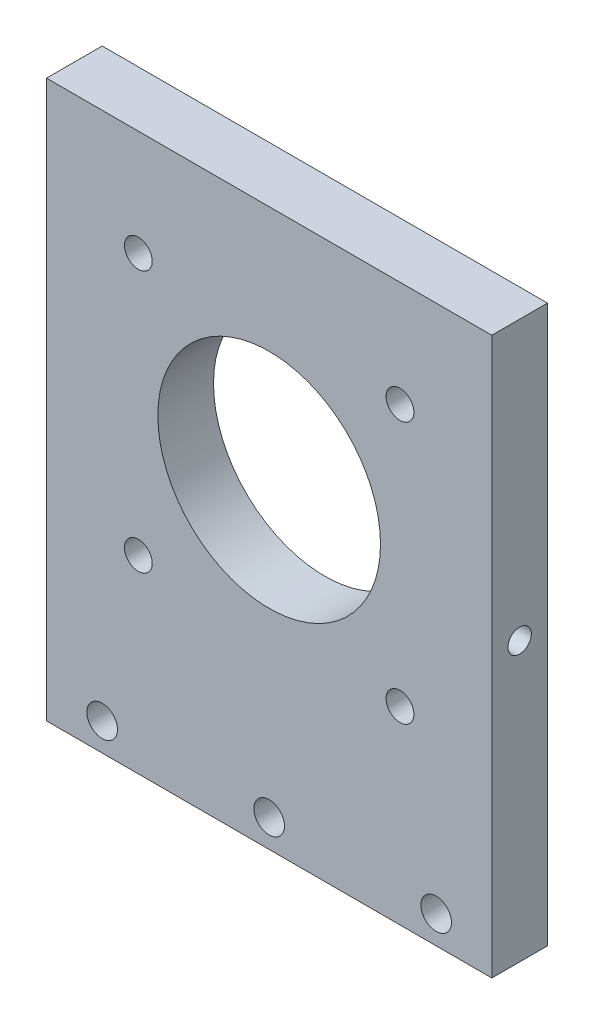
ISO-10303-21;
HEADER;
FILE_DESCRIPTION(('STEP AP214'),'2;1');
FILE_NAME('part.step','',(''),(''),'','','');
FILE_SCHEMA(('AUTOMOTIVE_DESIGN { 1 0 10303 214 1 1 1 1 }'));
ENDSEC;
DATA;
#1=APPLICATION_CONTEXT('core data for automotive mechanical design processes');
#2=APPLICATION_PROTOCOL_DEFINITION('international standard','automotive_design',2000,#1);
#3=PRODUCT_CONTEXT('',#1,'mechanical');
#4=PRODUCT('Part','Part','',(#3));
#5=PRODUCT_RELATED_PRODUCT_CATEGORY('part','',(#4));
#6=PRODUCT_DEFINITION_FORMATION('','',#4);
#7=PRODUCT_DEFINITION_CONTEXT('part definition',#1,'design');
#8=PRODUCT_DEFINITION('design','',#6,#7);
#9=PRODUCT_DEFINITION_SHAPE('','',#8);
#10=(LENGTH_UNIT() NAMED_UNIT(*) SI_UNIT(.MILLI.,.METRE.));
#11=(NAMED_UNIT(*) PLANE_ANGLE_UNIT() SI_UNIT($,.RADIAN.));
#12=(NAMED_UNIT(*) SI_UNIT($,.STERADIAN.) SOLID_ANGLE_UNIT());
#13=UNCERTAINTY_MEASURE_WITH_UNIT(LENGTH_MEASURE(1.E-05),#10,'distance_accuracy_value','');
#14=(GEOMETRIC_REPRESENTATION_CONTEXT(3) GLOBAL_UNCERTAINTY_ASSIGNED_CONTEXT((#13)) GLOBAL_UNIT_ASSIGNED_CONTEXT((#10,
#11,#12)) REPRESENTATION_CONTEXT('',''));
#15=CARTESIAN_POINT('',(0.,0.,0.));
#16=DIRECTION('',(0.,0.,1.));
#17=DIRECTION('',(1.,0.,0.));
#18=AXIS2_PLACEMENT_3D('',#15,#16,#17);
#19=CARTESIAN_POINT('',(-40.,50.,10.));
#20=DIRECTION('',(1.,0.,0.));
#21=DIRECTION('',(0.,1.,0.));
#22=AXIS2_PLACEMENT_3D('',#19,#20,#21);
#23=PLANE('',#22);
#24=CARTESIAN_POINT('',(-40.,0.,5.));
#25=DIRECTION('',(-1.,0.,0.));
#26=DIRECTION('',(0.,0.,1.));
#27=AXIS2_PLACEMENT_3D('',#24,#25,#26);
#28=CIRCLE('',#27,2.09999999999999);
#29=CARTESIAN_POINT('',(-40.,0.,7.09999999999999));
#30=VERTEX_POINT('',#29);
#31=EDGE_CURVE('E102',#30,#30,#28,.T.);
#32=ORIENTED_EDGE('',*,*,#31,.F.);
#33=EDGE_LOOP('',(#32));
#34=FACE_BOUND('',#33,.T.);
#35=DIRECTION('',(0.,-1.,0.));
#36=VECTOR('',#35,1.);
#37=CARTESIAN_POINT('',(-40.,50.,0.));
#38=LINE('',#37,#36);
#39=CARTESIAN_POINT('',(-40.,50.,0.));
#40=VERTEX_POINT('',#39);
#41=CARTESIAN_POINT('',(-40.,-50.,0.));
#42=VERTEX_POINT('',#41);
#43=EDGE_CURVE('E160',#40,#42,#38,.T.);
#44=ORIENTED_EDGE('',*,*,#43,.T.);
#45=DIRECTION('',(0.,0.,-1.));
#46=VECTOR('',#45,1.);
#47=CARTESIAN_POINT('',(-40.,-50.,10.));
#48=LINE('',#47,#46);
#49=CARTESIAN_POINT('',(-40.,-50.,10.));
#50=VERTEX_POINT('',#49);
#51=EDGE_CURVE('E11',#50,#42,#48,.T.);
#52=ORIENTED_EDGE('',*,*,#51,.F.);
#53=DIRECTION('',(0.,-1.,0.));
#54=VECTOR('',#53,1.);
#55=CARTESIAN_POINT('',(-40.,50.,10.));
#56=LINE('',#55,#54);
#57=CARTESIAN_POINT('',(-40.,50.,10.));
#58=VERTEX_POINT('',#57);
#59=EDGE_CURVE('E161',#58,#50,#56,.T.);
#60=ORIENTED_EDGE('',*,*,#59,.F.);
#61=DIRECTION('',(0.,0.,-1.));
#62=VECTOR('',#61,1.);
#63=CARTESIAN_POINT('',(-40.,50.,10.));
#64=LINE('',#63,#62);
#65=EDGE_CURVE('E167',#58,#40,#64,.T.);
#66=ORIENTED_EDGE('',*,*,#65,.T.);
#67=EDGE_LOOP('',(#44,#52,#60,#66));
#68=FACE_BOUND('',#67,.T.);
#69=ADVANCED_FACE('F37',(#34,#68),#23,.F.);
#70=CARTESIAN_POINT('',(40.,-50.,10.));
#71=DIRECTION('',(0.,1.,0.));
#72=DIRECTION('',(-1.,0.,0.));
#73=AXIS2_PLACEMENT_3D('',#70,#71,#72);
#74=PLANE('',#73);
#75=DIRECTION('',(1.,0.,0.));
#76=VECTOR('',#75,1.);
#77=CARTESIAN_POINT('',(40.,-50.,0.));
#78=LINE('',#77,#76);
#79=CARTESIAN_POINT('',(40.,-50.,0.));
#80=VERTEX_POINT('',#79);
#81=EDGE_CURVE('E170',#42,#80,#78,.T.);
#82=ORIENTED_EDGE('',*,*,#81,.T.);
#83=DIRECTION('',(0.,0.,-1.));
#84=VECTOR('',#83,1.);
#85=CARTESIAN_POINT('',(40.,-50.,10.));
#86=LINE('',#85,#84);
#87=CARTESIAN_POINT('',(40.,-50.,10.));
#88=VERTEX_POINT('',#87);
#89=EDGE_CURVE('E45',#88,#80,#86,.T.);
#90=ORIENTED_EDGE('',*,*,#89,.F.);
#91=DIRECTION('',(1.,0.,0.));
#92=VECTOR('',#91,1.);
#93=CARTESIAN_POINT('',(40.,-50.,10.));
#94=LINE('',#93,#92);
#95=EDGE_CURVE('E84',#50,#88,#94,.T.);
#96=ORIENTED_EDGE('',*,*,#95,.F.);
#97=ORIENTED_EDGE('',*,*,#51,.T.);
#98=EDGE_LOOP('',(#82,#90,#96,#97));
#99=FACE_BOUND('',#98,.T.);
#100=ADVANCED_FACE('F194',(#99),#74,.F.);
#101=CARTESIAN_POINT('',(40.,50.,10.));
#102=DIRECTION('',(-1.,0.,0.));
#103=DIRECTION('',(0.,-1.,0.));
#104=AXIS2_PLACEMENT_3D('',#101,#102,#103);
#105=PLANE('',#104);
#106=CARTESIAN_POINT('',(40.,0.,5.));
#107=DIRECTION('',(1.,0.,0.));
#108=DIRECTION('',(0.,0.,-1.));
#109=AXIS2_PLACEMENT_3D('',#106,#107,#108);
#110=CIRCLE('',#109,2.09999999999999);
#111=CARTESIAN_POINT('',(40.,0.,2.90000000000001));
#112=VERTEX_POINT('',#111);
#113=EDGE_CURVE('E101',#112,#112,#110,.T.);
#114=ORIENTED_EDGE('',*,*,#113,.F.);
#115=EDGE_LOOP('',(#114));
#116=FACE_BOUND('',#115,.T.);
#117=DIRECTION('',(0.,1.,0.));
#118=VECTOR('',#117,1.);
#119=CARTESIAN_POINT('',(40.,50.,0.));
#120=LINE('',#119,#118);
#121=CARTESIAN_POINT('',(40.,50.,0.));
#122=VERTEX_POINT('',#121);
#123=EDGE_CURVE('E71',#80,#122,#120,.T.);
#124=ORIENTED_EDGE('',*,*,#123,.T.);
#125=DIRECTION('',(0.,0.,-1.));
#126=VECTOR('',#125,1.);
#127=CARTESIAN_POINT('',(40.,50.,10.));
#128=LINE('',#127,#126);
#129=CARTESIAN_POINT('',(40.,50.,10.));
#130=VERTEX_POINT('',#129);
#131=EDGE_CURVE('E175',#130,#122,#128,.T.);
#132=ORIENTED_EDGE('',*,*,#131,.F.);
#133=DIRECTION('',(0.,1.,0.));
#134=VECTOR('',#133,1.);
#135=CARTESIAN_POINT('',(40.,50.,10.));
#136=LINE('',#135,#134);
#137=EDGE_CURVE('E164',#88,#130,#136,.T.);
#138=ORIENTED_EDGE('',*,*,#137,.F.);
#139=ORIENTED_EDGE('',*,*,#89,.T.);
#140=EDGE_LOOP('',(#124,#132,#138,#139));
#141=FACE_BOUND('',#140,.T.);
#142=ADVANCED_FACE('F177',(#116,#141),#105,.F.);
#143=CARTESIAN_POINT('',(40.,50.,10.));
#144=DIRECTION('',(0.,-1.,0.));
#145=DIRECTION('',(0.,0.,-1.));
#146=AXIS2_PLACEMENT_3D('',#143,#144,#145);
#147=PLANE('',#146);
#148=DIRECTION('',(-1.,0.,0.));
#149=VECTOR('',#148,1.);
#150=CARTESIAN_POINT('',(40.,50.,0.));
#151=LINE('',#150,#149);
#152=EDGE_CURVE('E77',#122,#40,#151,.T.);
#153=ORIENTED_EDGE('',*,*,#152,.T.);
#154=ORIENTED_EDGE('',*,*,#65,.F.);
#155=DIRECTION('',(-1.,0.,0.));
#156=VECTOR('',#155,1.);
#157=CARTESIAN_POINT('',(40.,50.,10.));
#158=LINE('',#157,#156);
#159=EDGE_CURVE('E53',#130,#58,#158,.T.);
#160=ORIENTED_EDGE('',*,*,#159,.F.);
#161=ORIENTED_EDGE('',*,*,#131,.T.);
#162=EDGE_LOOP('',(#153,#154,#160,#161));
#163=FACE_BOUND('',#162,.T.);
#164=ADVANCED_FACE('F184',(#163),#147,.F.);
#165=CARTESIAN_POINT('',(0.,0.,10.));
#166=DIRECTION('',(0.,0.,-1.));
#167=DIRECTION('',(-1.,0.,0.));
#168=AXIS2_PLACEMENT_3D('',#165,#166,#167);
#169=PLANE('',#168);
#170=CARTESIAN_POINT('',(23.5,31.,10.));
#171=DIRECTION('',(0.,0.,-1.));
#172=DIRECTION('',(-1.,0.,0.));
#173=AXIS2_PLACEMENT_3D('',#170,#171,#172);
#174=CIRCLE('',#173,2.5);
#175=CARTESIAN_POINT('',(21.,31.,10.));
#176=VERTEX_POINT('',#175);
#177=EDGE_CURVE('E113',#176,#176,#174,.T.);
#178=ORIENTED_EDGE('',*,*,#177,.T.);
#179=EDGE_LOOP('',(#178));
#180=FACE_BOUND('',#179,.T.);
#181=CARTESIAN_POINT('',(-23.5,31.,10.));
#182=DIRECTION('',(0.,0.,-1.));
#183=DIRECTION('',(-1.,0.,0.));
#184=AXIS2_PLACEMENT_3D('',#181,#182,#183);
#185=CIRCLE('',#184,2.5);
#186=CARTESIAN_POINT('',(-26.,31.,10.));
#187=VERTEX_POINT('',#186);
#188=EDGE_CURVE('E120',#187,#187,#185,.T.);
#189=ORIENTED_EDGE('',*,*,#188,.T.);
#190=EDGE_LOOP('',(#189));
#191=FACE_BOUND('',#190,.T.);
#192=CARTESIAN_POINT('',(-23.5,-16.,10.));
#193=DIRECTION('',(0.,0.,-1.));
#194=DIRECTION('',(-1.,0.,0.));
#195=AXIS2_PLACEMENT_3D('',#192,#193,#194);
#196=CIRCLE('',#195,2.5);
#197=CARTESIAN_POINT('',(-26.,-16.,10.));
#198=VERTEX_POINT('',#197);
#199=EDGE_CURVE('E126',#198,#198,#196,.T.);
#200=ORIENTED_EDGE('',*,*,#199,.T.);
#201=EDGE_LOOP('',(#200));
#202=FACE_BOUND('',#201,.T.);
#203=CARTESIAN_POINT('',(23.5,-16.,10.));
#204=DIRECTION('',(0.,0.,-1.));
#205=DIRECTION('',(-1.,0.,0.));
#206=AXIS2_PLACEMENT_3D('',#203,#204,#205);
#207=CIRCLE('',#206,2.5);
#208=CARTESIAN_POINT('',(21.,-16.,10.));
#209=VERTEX_POINT('',#208);
#210=EDGE_CURVE('E132',#209,#209,#207,.T.);
#211=ORIENTED_EDGE('',*,*,#210,.T.);
#212=EDGE_LOOP('',(#211));
#213=FACE_BOUND('',#212,.T.);
#214=CARTESIAN_POINT('',(0.,7.5,10.));
#215=DIRECTION('',(0.,0.,-1.));
#216=DIRECTION('',(-1.,0.,0.));
#217=AXIS2_PLACEMENT_3D('',#214,#215,#216);
#218=CIRCLE('',#217,20.);
#219=CARTESIAN_POINT('',(-20.,7.5,10.));
#220=VERTEX_POINT('',#219);
#221=EDGE_CURVE('E137',#220,#220,#218,.T.);
#222=ORIENTED_EDGE('',*,*,#221,.T.);
#223=EDGE_LOOP('',(#222));
#224=FACE_BOUND('',#223,.T.);
#225=CARTESIAN_POINT('',(30.,-45.,9.99999999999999));
#226=DIRECTION('',(0.,0.,-1.));
#227=DIRECTION('',(-1.,0.,0.));
#228=AXIS2_PLACEMENT_3D('',#225,#226,#227);
#229=CIRCLE('',#228,2.74999999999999);
#230=CARTESIAN_POINT('',(27.25,-45.,9.99999999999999));
#231=VERTEX_POINT('',#230);
#232=EDGE_CURVE('E145',#231,#231,#229,.T.);
#233=ORIENTED_EDGE('',*,*,#232,.T.);
#234=EDGE_LOOP('',(#233));
#235=FACE_BOUND('',#234,.T.);
#236=CARTESIAN_POINT('',(0.,-45.,9.99999999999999));
#237=DIRECTION('',(0.,0.,-1.));
#238=DIRECTION('',(-1.,0.,0.));
#239=AXIS2_PLACEMENT_3D('',#236,#237,#238);
#240=CIRCLE('',#239,2.74999999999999);
#241=CARTESIAN_POINT('',(-2.74999999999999,-45.,9.99999999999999));
#242=VERTEX_POINT('',#241);
#243=EDGE_CURVE('E151',#242,#242,#240,.T.);
#244=ORIENTED_EDGE('',*,*,#243,.T.);
#245=EDGE_LOOP('',(#244));
#246=FACE_BOUND('',#245,.T.);
#247=CARTESIAN_POINT('',(-30.,-45.,9.99999999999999));
#248=DIRECTION('',(0.,0.,-1.));
#249=DIRECTION('',(-1.,0.,0.));
#250=AXIS2_PLACEMENT_3D('',#247,#248,#249);
#251=CIRCLE('',#250,2.74999999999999);
#252=CARTESIAN_POINT('',(-32.75,-45.,9.99999999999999));
#253=VERTEX_POINT('',#252);
#254=EDGE_CURVE('E157',#253,#253,#251,.T.);
#255=ORIENTED_EDGE('',*,*,#254,.T.);
#256=EDGE_LOOP('',(#255));
#257=FACE_BOUND('',#256,.T.);
#258=ORIENTED_EDGE('',*,*,#59,.T.);
#259=ORIENTED_EDGE('',*,*,#95,.T.);
#260=ORIENTED_EDGE('',*,*,#137,.T.);
#261=ORIENTED_EDGE('',*,*,#159,.T.);
#262=EDGE_LOOP('',(#258,#259,#260,#261));
#263=FACE_BOUND('',#262,.T.);
#264=ADVANCED_FACE('F186',(#180,#191,#202,#213,#224,#235,#246,#257,#263),#169,.F.);
#265=CARTESIAN_POINT('',(0.,0.,0.));
#266=DIRECTION('',(0.,0.,-1.));
#267=DIRECTION('',(-1.,0.,0.));
#268=AXIS2_PLACEMENT_3D('',#265,#266,#267);
#269=PLANE('',#268);
#270=CARTESIAN_POINT('',(23.5,31.,0.));
#271=DIRECTION('',(0.,0.,-1.));
#272=DIRECTION('',(-1.,0.,0.));
#273=AXIS2_PLACEMENT_3D('',#270,#271,#272);
#274=CIRCLE('',#273,2.5);
#275=CARTESIAN_POINT('',(21.,31.,0.));
#276=VERTEX_POINT('',#275);
#277=EDGE_CURVE('E117',#276,#276,#274,.T.);
#278=ORIENTED_EDGE('',*,*,#277,.F.);
#279=EDGE_LOOP('',(#278));
#280=FACE_BOUND('',#279,.T.);
#281=CARTESIAN_POINT('',(-23.5,31.,0.));
#282=DIRECTION('',(0.,0.,-1.));
#283=DIRECTION('',(-1.,0.,0.));
#284=AXIS2_PLACEMENT_3D('',#281,#282,#283);
#285=CIRCLE('',#284,2.5);
#286=CARTESIAN_POINT('',(-26.,31.,0.));
#287=VERTEX_POINT('',#286);
#288=EDGE_CURVE('E123',#287,#287,#285,.T.);
#289=ORIENTED_EDGE('',*,*,#288,.F.);
#290=EDGE_LOOP('',(#289));
#291=FACE_BOUND('',#290,.T.);
#292=CARTESIAN_POINT('',(-23.5,-16.,0.));
#293=DIRECTION('',(0.,0.,-1.));
#294=DIRECTION('',(-1.,0.,0.));
#295=AXIS2_PLACEMENT_3D('',#292,#293,#294);
#296=CIRCLE('',#295,2.5);
#297=CARTESIAN_POINT('',(-26.,-16.,0.));
#298=VERTEX_POINT('',#297);
#299=EDGE_CURVE('E129',#298,#298,#296,.T.);
#300=ORIENTED_EDGE('',*,*,#299,.F.);
#301=EDGE_LOOP('',(#300));
#302=FACE_BOUND('',#301,.T.);
#303=CARTESIAN_POINT('',(23.5,-16.,0.));
#304=DIRECTION('',(0.,0.,-1.));
#305=DIRECTION('',(-1.,0.,0.));
#306=AXIS2_PLACEMENT_3D('',#303,#304,#305);
#307=CIRCLE('',#306,2.5);
#308=CARTESIAN_POINT('',(21.,-16.,0.));
#309=VERTEX_POINT('',#308);
#310=EDGE_CURVE('E112',#309,#309,#307,.T.);
#311=ORIENTED_EDGE('',*,*,#310,.F.);
#312=EDGE_LOOP('',(#311));
#313=FACE_BOUND('',#312,.T.);
#314=CARTESIAN_POINT('',(0.,7.5,0.));
#315=DIRECTION('',(0.,0.,-1.));
#316=DIRECTION('',(-1.,0.,0.));
#317=AXIS2_PLACEMENT_3D('',#314,#315,#316);
#318=CIRCLE('',#317,20.);
#319=CARTESIAN_POINT('',(-20.,7.5,0.));
#320=VERTEX_POINT('',#319);
#321=EDGE_CURVE('E116',#320,#320,#318,.T.);
#322=ORIENTED_EDGE('',*,*,#321,.F.);
#323=EDGE_LOOP('',(#322));
#324=FACE_BOUND('',#323,.T.);
#325=CARTESIAN_POINT('',(30.,-45.,0.));
#326=DIRECTION('',(0.,0.,-1.));
#327=DIRECTION('',(-1.,0.,0.));
#328=AXIS2_PLACEMENT_3D('',#325,#326,#327);
#329=CIRCLE('',#328,2.74999999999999);
#330=CARTESIAN_POINT('',(27.25,-45.,0.));
#331=VERTEX_POINT('',#330);
#332=EDGE_CURVE('E140',#331,#331,#329,.T.);
#333=ORIENTED_EDGE('',*,*,#332,.F.);
#334=EDGE_LOOP('',(#333));
#335=FACE_BOUND('',#334,.T.);
#336=CARTESIAN_POINT('',(0.,-45.,0.));
#337=DIRECTION('',(0.,0.,-1.));
#338=DIRECTION('',(-1.,0.,0.));
#339=AXIS2_PLACEMENT_3D('',#336,#337,#338);
#340=CIRCLE('',#339,2.74999999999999);
#341=CARTESIAN_POINT('',(-2.74999999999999,-45.,0.));
#342=VERTEX_POINT('',#341);
#343=EDGE_CURVE('E148',#342,#342,#340,.T.);
#344=ORIENTED_EDGE('',*,*,#343,.F.);
#345=EDGE_LOOP('',(#344));
#346=FACE_BOUND('',#345,.T.);
#347=CARTESIAN_POINT('',(-30.,-45.,0.));
#348=DIRECTION('',(0.,0.,-1.));
#349=DIRECTION('',(-1.,0.,0.));
#350=AXIS2_PLACEMENT_3D('',#347,#348,#349);
#351=CIRCLE('',#350,2.74999999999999);
#352=CARTESIAN_POINT('',(-32.75,-45.,0.));
#353=VERTEX_POINT('',#352);
#354=EDGE_CURVE('E154',#353,#353,#351,.T.);
#355=ORIENTED_EDGE('',*,*,#354,.F.);
#356=EDGE_LOOP('',(#355));
#357=FACE_BOUND('',#356,.T.);
#358=ORIENTED_EDGE('',*,*,#43,.F.);
#359=ORIENTED_EDGE('',*,*,#152,.F.);
#360=ORIENTED_EDGE('',*,*,#123,.F.);
#361=ORIENTED_EDGE('',*,*,#81,.F.);
#362=EDGE_LOOP('',(#358,#359,#360,#361));
#363=FACE_BOUND('',#362,.T.);
#364=ADVANCED_FACE('F180',(#280,#291,#302,#313,#324,#335,#346,#357,#363),#269,.T.);
#365=CARTESIAN_POINT('',(-30.,-45.,0.));
#366=DIRECTION('',(0.,0.,-1.));
#367=DIRECTION('',(-1.,0.,0.));
#368=AXIS2_PLACEMENT_3D('',#365,#366,#367);
#369=CYLINDRICAL_SURFACE('',#368,2.74999999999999);
#370=ORIENTED_EDGE('',*,*,#254,.F.);
#371=EDGE_LOOP('',(#370));
#372=FACE_BOUND('',#371,.T.);
#373=ORIENTED_EDGE('',*,*,#354,.T.);
#374=EDGE_LOOP('',(#373));
#375=FACE_BOUND('',#374,.T.);
#376=ADVANCED_FACE('F244',(#372,#375),#369,.F.);
#377=CARTESIAN_POINT('',(0.,-45.,0.));
#378=DIRECTION('',(0.,0.,-1.));
#379=DIRECTION('',(-1.,0.,0.));
#380=AXIS2_PLACEMENT_3D('',#377,#378,#379);
#381=CYLINDRICAL_SURFACE('',#380,2.74999999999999);
#382=ORIENTED_EDGE('',*,*,#243,.F.);
#383=EDGE_LOOP('',(#382));
#384=FACE_BOUND('',#383,.T.);
#385=ORIENTED_EDGE('',*,*,#343,.T.);
#386=EDGE_LOOP('',(#385));
#387=FACE_BOUND('',#386,.T.);
#388=ADVANCED_FACE('F240',(#384,#387),#381,.F.);
#389=CARTESIAN_POINT('',(30.,-45.,0.));
#390=DIRECTION('',(0.,0.,-1.));
#391=DIRECTION('',(-1.,0.,0.));
#392=AXIS2_PLACEMENT_3D('',#389,#390,#391);
#393=CYLINDRICAL_SURFACE('',#392,2.74999999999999);
#394=ORIENTED_EDGE('',*,*,#232,.F.);
#395=EDGE_LOOP('',(#394));
#396=FACE_BOUND('',#395,.T.);
#397=ORIENTED_EDGE('',*,*,#332,.T.);
#398=EDGE_LOOP('',(#397));
#399=FACE_BOUND('',#398,.T.);
#400=ADVANCED_FACE('F236',(#396,#399),#393,.F.);
#401=CARTESIAN_POINT('',(0.,7.5,10.));
#402=DIRECTION('',(0.,0.,-1.));
#403=DIRECTION('',(-1.,0.,0.));
#404=AXIS2_PLACEMENT_3D('',#401,#402,#403);
#405=CYLINDRICAL_SURFACE('',#404,20.);
#406=ORIENTED_EDGE('',*,*,#221,.F.);
#407=EDGE_LOOP('',(#406));
#408=FACE_BOUND('',#407,.T.);
#409=ORIENTED_EDGE('',*,*,#321,.T.);
#410=EDGE_LOOP('',(#409));
#411=FACE_BOUND('',#410,.T.);
#412=ADVANCED_FACE('F232',(#408,#411),#405,.F.);
#413=CARTESIAN_POINT('',(23.5,-16.,10.));
#414=DIRECTION('',(0.,0.,-1.));
#415=DIRECTION('',(-1.,0.,0.));
#416=AXIS2_PLACEMENT_3D('',#413,#414,#415);
#417=CYLINDRICAL_SURFACE('',#416,2.5);
#418=ORIENTED_EDGE('',*,*,#210,.F.);
#419=EDGE_LOOP('',(#418));
#420=FACE_BOUND('',#419,.T.);
#421=ORIENTED_EDGE('',*,*,#310,.T.);
#422=EDGE_LOOP('',(#421));
#423=FACE_BOUND('',#422,.T.);
#424=ADVANCED_FACE('F228',(#420,#423),#417,.F.);
#425=CARTESIAN_POINT('',(-23.5,-16.,10.));
#426=DIRECTION('',(0.,0.,-1.));
#427=DIRECTION('',(-1.,0.,0.));
#428=AXIS2_PLACEMENT_3D('',#425,#426,#427);
#429=CYLINDRICAL_SURFACE('',#428,2.5);
#430=ORIENTED_EDGE('',*,*,#199,.F.);
#431=EDGE_LOOP('',(#430));
#432=FACE_BOUND('',#431,.T.);
#433=ORIENTED_EDGE('',*,*,#299,.T.);
#434=EDGE_LOOP('',(#433));
#435=FACE_BOUND('',#434,.T.);
#436=ADVANCED_FACE('F224',(#432,#435),#429,.F.);
#437=CARTESIAN_POINT('',(-23.5,31.,10.));
#438=DIRECTION('',(0.,0.,-1.));
#439=DIRECTION('',(-1.,0.,0.));
#440=AXIS2_PLACEMENT_3D('',#437,#438,#439);
#441=CYLINDRICAL_SURFACE('',#440,2.5);
#442=ORIENTED_EDGE('',*,*,#188,.F.);
#443=EDGE_LOOP('',(#442));
#444=FACE_BOUND('',#443,.T.);
#445=ORIENTED_EDGE('',*,*,#288,.T.);
#446=EDGE_LOOP('',(#445));
#447=FACE_BOUND('',#446,.T.);
#448=ADVANCED_FACE('F220',(#444,#447),#441,.F.);
#449=CARTESIAN_POINT('',(23.5,31.,10.));
#450=DIRECTION('',(0.,0.,-1.));
#451=DIRECTION('',(-1.,0.,0.));
#452=AXIS2_PLACEMENT_3D('',#449,#450,#451);
#453=CYLINDRICAL_SURFACE('',#452,2.5);
#454=ORIENTED_EDGE('',*,*,#177,.F.);
#455=EDGE_LOOP('',(#454));
#456=FACE_BOUND('',#455,.T.);
#457=ORIENTED_EDGE('',*,*,#277,.T.);
#458=EDGE_LOOP('',(#457));
#459=FACE_BOUND('',#458,.T.);
#460=ADVANCED_FACE('F216',(#456,#459),#453,.F.);
#461=CARTESIAN_POINT('',(30.,0.,5.));
#462=DIRECTION('',(1.,0.,0.));
#463=DIRECTION('',(0.,0.,-1.));
#464=AXIS2_PLACEMENT_3D('',#461,#462,#463);
#465=CONICAL_SURFACE('',#464,2.1,1.02974425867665);
#466=CARTESIAN_POINT('',(28.7381927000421,0.,5.));
#467=VERTEX_POINT('',#466);
#468=VERTEX_LOOP('',#467);
#469=FACE_BOUND('',#468,.T.);
#470=CARTESIAN_POINT('',(30.,0.,5.));
#471=DIRECTION('',(1.,0.,0.));
#472=DIRECTION('',(0.,0.,-1.));
#473=AXIS2_PLACEMENT_3D('',#470,#471,#472);
#474=CIRCLE('',#473,2.1);
#475=CARTESIAN_POINT('',(30.,0.,2.9));
#476=VERTEX_POINT('',#475);
#477=EDGE_CURVE('E105',#476,#476,#474,.T.);
#478=ORIENTED_EDGE('',*,*,#477,.T.);
#479=EDGE_LOOP('',(#478));
#480=FACE_BOUND('',#479,.T.);
#481=ADVANCED_FACE('F212',(#469,#480),#465,.F.);
#482=CARTESIAN_POINT('',(40.,0.,5.));
#483=DIRECTION('',(1.,0.,0.));
#484=DIRECTION('',(0.,0.,-1.));
#485=AXIS2_PLACEMENT_3D('',#482,#483,#484);
#486=CYLINDRICAL_SURFACE('',#485,2.09999999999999);
#487=ORIENTED_EDGE('',*,*,#477,.F.);
#488=EDGE_LOOP('',(#487));
#489=FACE_BOUND('',#488,.T.);
#490=ORIENTED_EDGE('',*,*,#113,.T.);
#491=EDGE_LOOP('',(#490));
#492=FACE_BOUND('',#491,.T.);
#493=ADVANCED_FACE('F95',(#489,#492),#486,.F.);
#494=CARTESIAN_POINT('',(-30.,0.,5.));
#495=DIRECTION('',(-1.,0.,0.));
#496=DIRECTION('',(0.,0.,1.));
#497=AXIS2_PLACEMENT_3D('',#494,#495,#496);
#498=CONICAL_SURFACE('',#497,2.1,1.02974425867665);
#499=CARTESIAN_POINT('',(-28.7381927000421,0.,5.));
#500=VERTEX_POINT('',#499);
#501=VERTEX_LOOP('',#500);
#502=FACE_BOUND('',#501,.T.);
#503=CARTESIAN_POINT('',(-30.,0.,5.));
#504=DIRECTION('',(-1.,0.,0.));
#505=DIRECTION('',(0.,0.,1.));
#506=AXIS2_PLACEMENT_3D('',#503,#504,#505);
#507=CIRCLE('',#506,2.1);
#508=CARTESIAN_POINT('',(-30.,0.,7.1));
#509=VERTEX_POINT('',#508);
#510=EDGE_CURVE('E99',#509,#509,#507,.T.);
#511=ORIENTED_EDGE('',*,*,#510,.T.);
#512=EDGE_LOOP('',(#511));
#513=FACE_BOUND('',#512,.T.);
#514=ADVANCED_FACE('F91',(#502,#513),#498,.F.);
#515=CARTESIAN_POINT('',(-40.,0.,5.));
#516=DIRECTION('',(-1.,0.,0.));
#517=DIRECTION('',(0.,0.,1.));
#518=AXIS2_PLACEMENT_3D('',#515,#516,#517);
#519=CYLINDRICAL_SURFACE('',#518,2.09999999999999);
#520=ORIENTED_EDGE('',*,*,#510,.F.);
#521=EDGE_LOOP('',(#520));
#522=FACE_BOUND('',#521,.T.);
#523=ORIENTED_EDGE('',*,*,#31,.T.);
#524=EDGE_LOOP('',(#523));
#525=FACE_BOUND('',#524,.T.);
#526=ADVANCED_FACE('F94',(#522,#525),#519,.F.);
#527=CLOSED_SHELL('',(#69,#100,#142,#164,#264,#364,#376,#388,#400,#412,#424,#436,#448,#460,#481,
#493,#514,#526));
#528=MANIFOLD_SOLID_BREP('B2',#527);
#529=ADVANCED_BREP_SHAPE_REPRESENTATION('',(#18,#528),#14);
#530=SHAPE_DEFINITION_REPRESENTATION(#9,#529);
ENDSEC;
END-ISO-10303-21;
